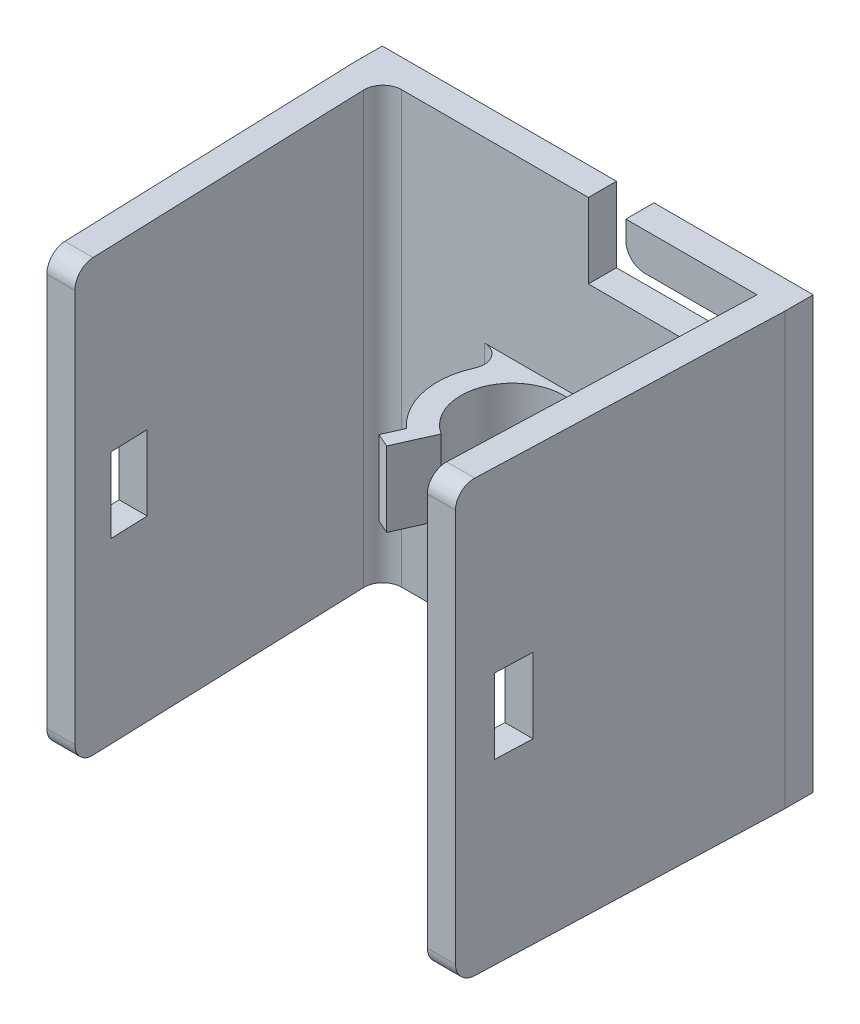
from build123d import *

# Parameters (mm, degrees)
ESQUISSE1_W                  = 23
ESQUISSE1_H                  = 23
BOSS_EXTRU_1_DEPTH           = 1.5
BOSS_EXTRU_2_DEPTH           = 23
ENL_V_MAT_EXTRU_1_DEPTH      = 34.108674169
ENL_V_MAT_EXTRU_1_DEPTH_BACK = 34.108674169
ESQUISSE3_W                  = 2
ESQUISSE3_H                  = 4
ESQUISSE6_R                  = 4
ESQUISSE6_R_2                = 2.75
BOSS_EXTRU_3_DEPTH           = 2
CONG_1_R                     = 1
ENL_V_MAT_EXTRU_2_DEPTH      = 34.825625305
ENL_V_MAT_EXTRU_2_DEPTH_BACK = 34.825625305
BOSS_EXTRU_4_DEPTH           = 4
ESQUISSE9_W                  = 9
ESQUISSE9_H                  = 2
ENL_V_MAT_EXTRU_3_DEPTH      = 4
ESQUISSE10_W                 = 2
ESQUISSE10_H                 = 2
ENL_V_MAT_EXTRU_4_DEPTH      = 4
CONG_2_R                     = 1


with BuildPart() as part:
    # Esquisse1 → Boss.-Extru.1 (new body)
    with BuildSketch(Plane.XY):
        with Locations((-13.393230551, -0.087121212)):
            Rectangle(ESQUISSE1_W, ESQUISSE1_H)
    extrude(amount=BOSS_EXTRU_1_DEPTH)

    # Esquisse2 → Boss.-Extru.2 (add)
    with BuildSketch(Plane.XZ.offset(11.587121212)):
        Polygon((-24.893230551, 1.5), (-24.29957747, 18.5), (-22.79957747, 18.5), (-23.393230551, 1.5), align=None)
        Polygon((-3.393230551, 1.5), (-1.893230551, 1.5), (-2.486883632, 18.5), (-3.986883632, 18.5), align=None)
    extrude(amount=-BOSS_EXTRU_2_DEPTH)

    # Esquisse3 → Enl_v. mat.-Extru.1 (cut, two sides: drawn at the far end of the back side and taken through both)
    with BuildSketch(Plane(origin=(0, 0, 0), x_dir=(0, 0, -1), z_dir=(1, 0, 0)).offset(-ENL_V_MAT_EXTRU_1_DEPTH_BACK)):
        with Locations((-15.5, -0.087121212)):
            Rectangle(ESQUISSE3_W, ESQUISSE3_H)
    extrude(amount=ENL_V_MAT_EXTRU_1_DEPTH + ENL_V_MAT_EXTRU_1_DEPTH_BACK, mode=Mode.SUBTRACT)

    # Esquisse6 → Boss.-Extru.3 (add, symmetric)
    with BuildSketch(Plane(origin=(0, -0.087121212, 0), x_dir=(1, 0, 0), z_dir=(0, 1, 0))):
        with Locations((-13.393230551, -4.557248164)):
            Circle(ESQUISSE6_R)
        with Locations(Location((-13.393230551, -4.557248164, 0), (0, 0, 270))):
            Circle(ESQUISSE6_R_2, mode=Mode.SUBTRACT)
    extrude(amount=BOSS_EXTRU_3_DEPTH, both=True)

    # Cong_1
    cong_1_edges = [part.edges().sort_by_distance(p)[0] for p in [
        (-10.813844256, -0.087121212, 1.5),
        (-15.972616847, -0.087121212, 1.5),
    ]]
    fillet(cong_1_edges, radius=CONG_1_R)

    # Esquisse7 → Enl_v. mat.-Extru.2 (cut, two sides: drawn at the far end of the back side and taken through both)
    with BuildSketch(Plane(origin=(0, 1.912878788, 0), x_dir=(1, 0, 0), z_dir=(0, 1, 0)).offset(-ENL_V_MAT_EXTRU_2_DEPTH_BACK)):
        Polygon((-13.393230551, -3.509301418), (-10.029249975, -11.033468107), (-16.757211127, -11.033468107), align=None)
    extrude(amount=ENL_V_MAT_EXTRU_2_DEPTH + ENL_V_MAT_EXTRU_2_DEPTH_BACK, mode=Mode.SUBTRACT)

    # Esquisse8 → Boss.-Extru.4 (add)
    with BuildSketch(Plane(origin=(0, 1.912878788, 0), x_dir=(1, 0, 0), z_dir=(0, 1, 0))):
        Polygon((-14.892470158, -6.862628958), (-15.790409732, -8.871037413), (-16.518003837, -8.545737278), (-15.620064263, -6.537328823), align=None)
        Polygon((-11.166396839, -6.537328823), (-11.893990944, -6.862628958), (-10.996051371, -8.871037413), (-10.268457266, -8.545737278), align=None)
    extrude(amount=-BOSS_EXTRU_4_DEPTH)

    # Esquisse9 → Enl_v. mat.-Extru.3 (cut)
    with BuildSketch(Plane(origin=(0, 0, 0), x_dir=(-1, 0, 0), z_dir=(0, 0, -1))):
        with Locations((7.893230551, 8.412878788)):
            Rectangle(ESQUISSE9_W, ESQUISSE9_H)
    extrude(amount=-ENL_V_MAT_EXTRU_3_DEPTH, mode=Mode.SUBTRACT)

    # Esquisse10 → Enl_v. mat.-Extru.4 (cut)
    with BuildSketch(Plane(origin=(0, 0, 0), x_dir=(-1, 0, 0), z_dir=(0, 0, -1))):
        with Locations((11.393230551, 10.412878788)):
            Rectangle(ESQUISSE10_W, ESQUISSE10_H)
    extrude(amount=-ENL_V_MAT_EXTRU_4_DEPTH, mode=Mode.SUBTRACT)

    # Cong_2
    cong_2_edges = [part.edges().sort_by_distance(p)[0] for p in [
        (-23.393230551, -0.087121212, 1.5),
        (-23.54957747, 11.412878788, 18.5),
        (-23.54957747, -11.587121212, 18.5),
        (-3.393230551, -2.087121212, 1.5),
        (-10.393230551, 9.412878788, 0.75),
        (-3.236883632, 11.412878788, 18.5),
        (-3.236883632, -11.587121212, 18.5),
    ]]
    fillet(cong_2_edges, radius=CONG_2_R)


solid = part.part
